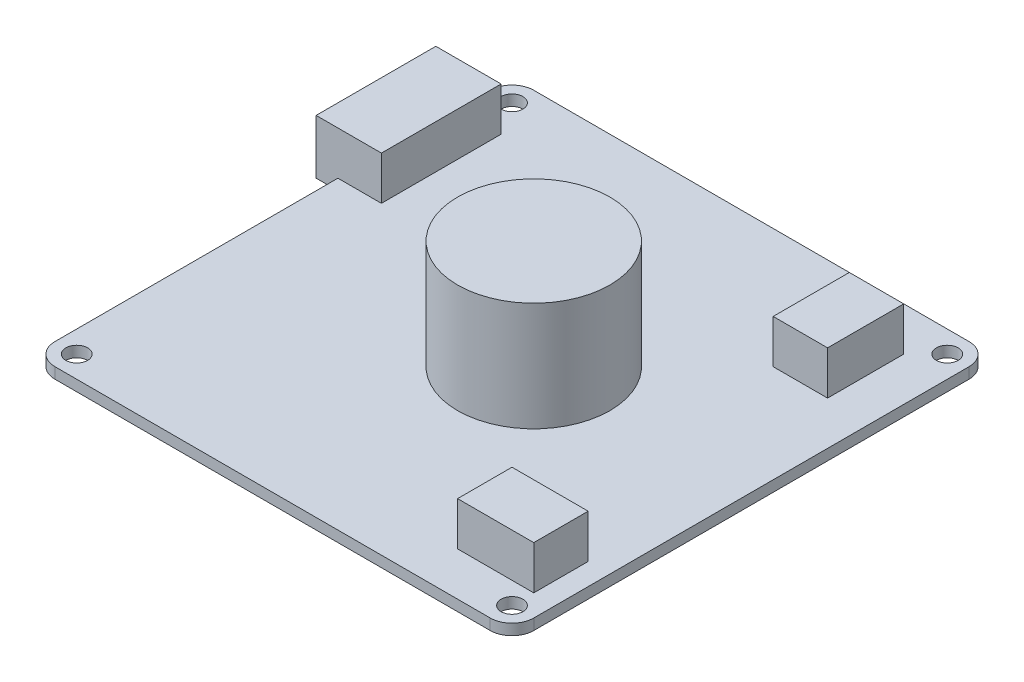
from build123d import *

# Parameters (mm, degrees)
SKETCH1_R           = 1
SKETCH1_W           = 7
SKETCH1_H           = 5
SKETCH1_R_2         = 7
SKETCH1_W_2         = 5
SKETCH1_H_2         = 7
BOSS_EXTRUDE1_DEPTH = 1
SKETCH1_3_R         = 7
BOSS_EXTRUDE2_DEPTH = 11
SKETCH1_4_W         = 4
SKETCH1_4_H         = 11
SKETCH1_4_W_2       = 2
SKETCH1_4_W_3       = 5
SKETCH1_4_H_2       = 7
SKETCH1_4_W_4       = 7
SKETCH1_4_H_3       = 5
BOSS_EXTRUDE3_DEPTH = 5


with BuildPart() as part:
    # Sketch1 → Boss-Extrude1 (new body)
    with BuildSketch(Plane(origin=(0, 0, 0), x_dir=(1, 0, 0), z_dir=(0, 1, 0))):
        with BuildLine():
            ThreePointArc((-22, -20), (-21.414213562, -21.414213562), (-20, -22))
            Line((-20, -22), (20, -22))
            ThreePointArc((20, -22), (21.414213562, -21.414213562), (22, -20))
            Line((22, -20), (22, 20))
            ThreePointArc((22, 20), (21.414213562, 21.414213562), (20, 22))
            Line((20, 22), (-20, 22))
            ThreePointArc((-20, 22), (-21.414213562, 21.414213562), (-22, 20))
            Line((-22, 20), (-22, 17))
            Line((-22, 17), (-18, 17))
            Line((-18, 17), (-18, 6))
            Line((-18, 6), (-22, 6))
            Line((-22, 6), (-22, -20))
        make_face()
        with Locations(Location((-20, -20, 0), (0, 0, 270))):
            Circle(SKETCH1_R, mode=Mode.SUBTRACT)
        with Locations(Location((20, -20, 0), (0, 0, 270))):
            Circle(SKETCH1_R, mode=Mode.SUBTRACT)
        with Locations((16.5, -15.5)):
            Rectangle(SKETCH1_W, SKETCH1_H, mode=Mode.SUBTRACT)
        with Locations(Location((-20, 20, 0), (0, 0, 270))):
            Circle(SKETCH1_R, mode=Mode.SUBTRACT)
        with Locations(Location((2, 0, 0), (0, 0, 270))):
            Circle(SKETCH1_R_2, mode=Mode.SUBTRACT)
        with Locations((15.5, 14.5)):
            Rectangle(SKETCH1_W_2, SKETCH1_H_2, mode=Mode.SUBTRACT)
        with Locations(Location((20, 20, 0), (0, 0, 270))):
            Circle(SKETCH1_R, mode=Mode.SUBTRACT)
    extrude(amount=BOSS_EXTRUDE1_DEPTH)

    # Sketch1_3 → Boss-Extrude2 (add)
    with BuildSketch(Plane(origin=(0, 0, 0), x_dir=(1, 0, 0), z_dir=(0, 1, 0))):
        with Locations(Location((2, 0, 0), (0, 0, 270))):
            Circle(SKETCH1_3_R)
    extrude(amount=BOSS_EXTRUDE2_DEPTH)

    # Sketch1_4 → Boss-Extrude3 (add)
    with BuildSketch(Plane(origin=(0, 0, 0), x_dir=(1, 0, 0), z_dir=(0, 1, 0))):
        with Locations((-20, 11.5)):
            Rectangle(SKETCH1_4_W, SKETCH1_4_H)
        with Locations((-23, 11.5)):
            Rectangle(SKETCH1_4_W_2, SKETCH1_4_H)
        with Locations((15.5, 14.5)):
            Rectangle(SKETCH1_4_W_3, SKETCH1_4_H_2)
        with Locations((16.5, -15.5)):
            Rectangle(SKETCH1_4_W_4, SKETCH1_4_H_3)
    extrude(amount=BOSS_EXTRUDE3_DEPTH)


solid = part.part
